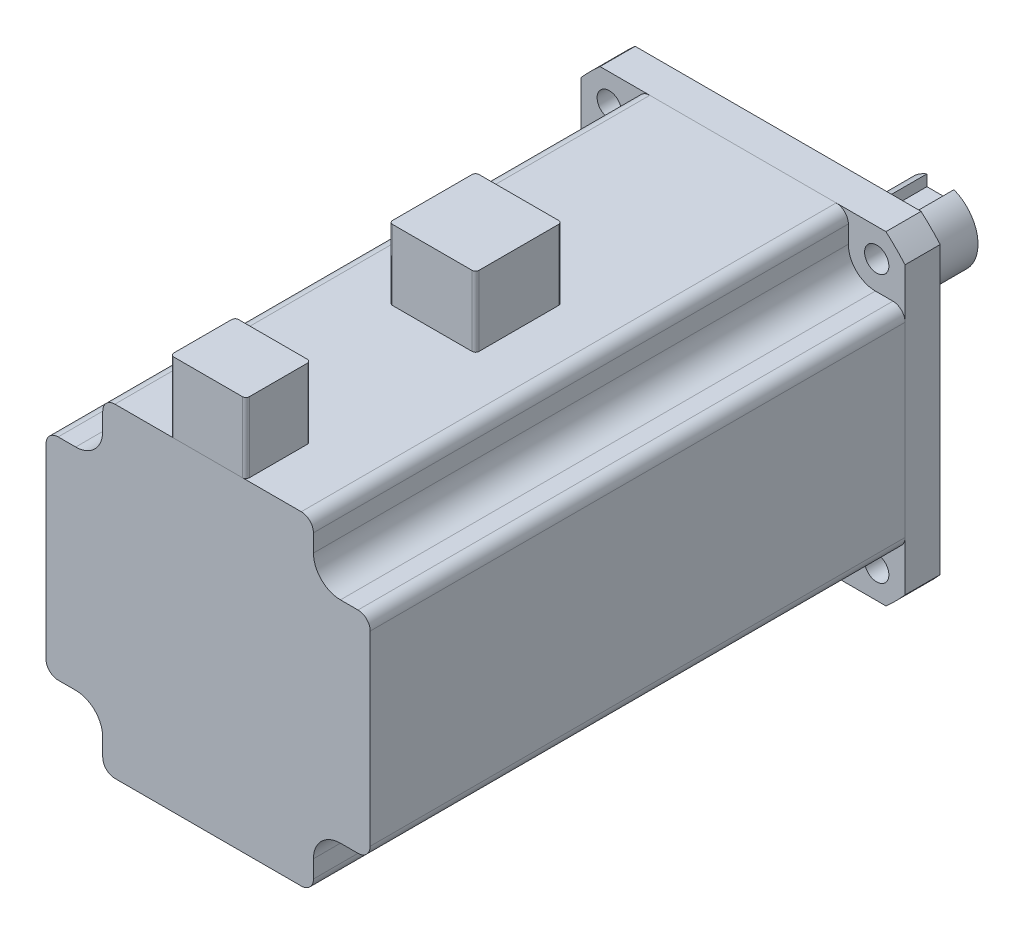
from build123d import *

# Parameters (mm, degrees)
SKETCH_1_R        = 2.25
EXTRUDE_1_DEPTH   = 6.5
SKETCH_2_R        = 25
EXTRUDE_2_DEPTH   = 3
EXTRUDE_3_DEPTH   = 27
EXTRUDE_4_DEPTH   = 99
EXTRUDE_5_DEPTH   = 13
EXTRUDE_5_2_DEPTH = 13


with BuildPart() as part:
    # Sketch 1 → Extrude 1 (new body)
    with BuildSketch(Plane.XY):
        with BuildLine():
            Line((-59.064382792, 2.814868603), (-111.979409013, 2.814868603))
            ThreePointArc((-111.979409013, 2.814868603), (-113.80616715, 1.099139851), (-115.521895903, -0.727618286))
            Line((-115.521895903, -0.727618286), (-115.521895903, -53.642644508))
            ThreePointArc((-115.521895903, -53.642644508), (-113.80616715, -55.469402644), (-111.979409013, -57.185131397))
            Line((-111.979409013, -57.185131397), (-59.064382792, -57.185131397))
            ThreePointArc((-59.064382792, -57.185131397), (-57.237624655, -55.469402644), (-55.521895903, -53.642644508))
            Line((-55.521895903, -53.642644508), (-55.521895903, -0.727618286))
            ThreePointArc((-55.521895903, -0.727618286), (-57.237624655, 1.099139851), (-59.064382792, 2.814868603))
        make_face()
        with Locations(Location((-110.270633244, -2.436394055, 0), (0, 0, 180))):
            Circle(SKETCH_1_R, mode=Mode.SUBTRACT)
        with Locations(Location((-60.773158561, -2.436394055, 0), (0, 0, 180))):
            Circle(SKETCH_1_R, mode=Mode.SUBTRACT)
        with Locations(Location((-60.773158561, -51.933868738, 0), (0, 0, 180))):
            Circle(SKETCH_1_R, mode=Mode.SUBTRACT)
        with Locations(Location((-110.270633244, -51.933868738, 0), (0, 0, 180))):
            Circle(SKETCH_1_R, mode=Mode.SUBTRACT)
    extrude(amount=EXTRUDE_1_DEPTH)

    # Sketch 2 → Extrude 2 (add)
    with BuildSketch(Plane(origin=(0, 0, 0), x_dir=(-1, 0, 0), z_dir=(0, 0, -1))):
        with Locations(Location((85.521895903, -27.185131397, 0), (0, 0, 180))):
            Circle(SKETCH_2_R)
    extrude(amount=EXTRUDE_2_DEPTH)

    # Sketch 3 → Extrude 3 (add)
    with BuildSketch(Plane(origin=(0, 0, -3), x_dir=(-1, 0, 0), z_dir=(0, 0, -1))):
        with BuildLine():
            Line((87.976441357, -20.629583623), (87.976441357, -22.685131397))
            Line((87.976441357, -22.685131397), (82.976441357, -22.685131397))
            Line((82.976441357, -22.685131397), (82.976441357, -20.664344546))
            ThreePointArc((82.976441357, -20.664344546), (85.570560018, -34.184962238), (87.976441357, -20.629583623))
        make_face()
    extrude(amount=EXTRUDE_3_DEPTH)


with BuildPart() as body_2:
    # Sketch 4 → Extrude 4 (new body)
    with BuildSketch(Plane.XY.offset(6.5)):
        with BuildLine():
            Line((-68.276175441, 2.814868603), (-102.767616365, 2.814868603))
            ThreePointArc((-102.767616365, 2.814868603), (-104.361632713, 2.154605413), (-105.021895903, 0.560589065))
            Line((-105.021895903, 0.560589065), (-105.021895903, -2.685131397))
            ThreePointArc((-105.021895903, -2.685131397), (-106.486361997, -6.220665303), (-110.021895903, -7.685131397))
            Line((-110.021895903, -7.685131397), (-113.267616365, -7.685131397))
            ThreePointArc((-113.267616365, -7.685131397), (-114.861632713, -8.345394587), (-115.521895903, -9.939410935))
            Line((-115.521895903, -9.939410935), (-115.521895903, -44.430851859))
            ThreePointArc((-115.521895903, -44.430851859), (-114.861632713, -46.024868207), (-113.267616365, -46.685131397))
            Line((-113.267616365, -46.685131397), (-110.021895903, -46.685131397))
            ThreePointArc((-110.021895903, -46.685131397), (-106.486361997, -48.149597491), (-105.021895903, -51.685131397))
            Line((-105.021895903, -51.685131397), (-105.021895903, -54.930851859))
            ThreePointArc((-105.021895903, -54.930851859), (-104.361632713, -56.524868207), (-102.767616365, -57.185131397))
            Line((-102.767616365, -57.185131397), (-68.276175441, -57.185131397))
            ThreePointArc((-68.276175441, -57.185131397), (-66.682159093, -56.524868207), (-66.021895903, -54.930851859))
            Line((-66.021895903, -54.930851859), (-66.021895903, -51.685131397))
            ThreePointArc((-66.021895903, -51.685131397), (-64.557429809, -48.149597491), (-61.021895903, -46.685131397))
            Line((-61.021895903, -46.685131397), (-57.776175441, -46.685131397))
            ThreePointArc((-57.776175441, -46.685131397), (-56.182159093, -46.024868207), (-55.521895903, -44.430851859))
            Line((-55.521895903, -44.430851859), (-55.521895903, -9.939410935))
            ThreePointArc((-55.521895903, -9.939410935), (-56.182159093, -8.345394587), (-57.776175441, -7.685131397))
            Line((-57.776175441, -7.685131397), (-61.021895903, -7.685131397))
            ThreePointArc((-61.021895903, -7.685131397), (-64.557429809, -6.220665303), (-66.021895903, -2.685131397))
            Line((-66.021895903, -2.685131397), (-66.021895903, 0.560589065))
            ThreePointArc((-66.021895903, 0.560589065), (-66.682159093, 2.154605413), (-68.276175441, 2.814868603))
        make_face()
    extrude(amount=EXTRUDE_4_DEPTH)


with BuildPart() as body_3:
    # Sketch 5 → Extrude 5 (new body)
    with BuildSketch(Plane(origin=(0, 2.814868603, 0), x_dir=(1, 0, 0), z_dir=(0, 1, 0))):
        with BuildLine():
            Line((-79.160412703, -93.5), (-91.883379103, -93.5))
            ThreePointArc((-91.883379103, -93.5), (-92.334878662, -93.687017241), (-92.521895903, -94.1385168))
            Line((-92.521895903, -94.1385168), (-92.521895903, -104.8614832))
            ThreePointArc((-92.521895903, -104.8614832), (-92.334878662, -105.312982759), (-91.883379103, -105.5))
            Line((-91.883379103, -105.5), (-79.160412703, -105.5))
            ThreePointArc((-79.160412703, -105.5), (-78.708913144, -105.312982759), (-78.521895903, -104.8614832))
            Line((-78.521895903, -104.8614832), (-78.521895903, -94.1385168))
            ThreePointArc((-78.521895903, -94.1385168), (-78.708913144, -93.687017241), (-79.160412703, -93.5))
        make_face()
    extrude(amount=EXTRUDE_5_DEPTH)


with BuildPart() as body_4:
    # Sketch 5 → Extrude 5 2 (new body)
    with BuildSketch(Plane(origin=(0, 2.814868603, 0), x_dir=(1, 0, 0), z_dir=(0, 1, 0))):
        with BuildLine():
            Line((-78.160412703, -48), (-92.883379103, -48))
            ThreePointArc((-92.883379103, -48), (-93.334878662, -48.187017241), (-93.521895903, -48.6385168))
            Line((-93.521895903, -48.6385168), (-93.521895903, -63.3614832))
            ThreePointArc((-93.521895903, -63.3614832), (-93.334878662, -63.812982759), (-92.883379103, -64))
            Line((-92.883379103, -64), (-78.160412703, -64))
            ThreePointArc((-78.160412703, -64), (-77.708913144, -63.812982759), (-77.521895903, -63.3614832))
            Line((-77.521895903, -63.3614832), (-77.521895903, -48.6385168))
            ThreePointArc((-77.521895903, -48.6385168), (-77.708913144, -48.187017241), (-78.160412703, -48))
        make_face()
    extrude(amount=EXTRUDE_5_2_DEPTH)


solid = Compound([part.part, body_2.part, body_3.part, body_4.part])
